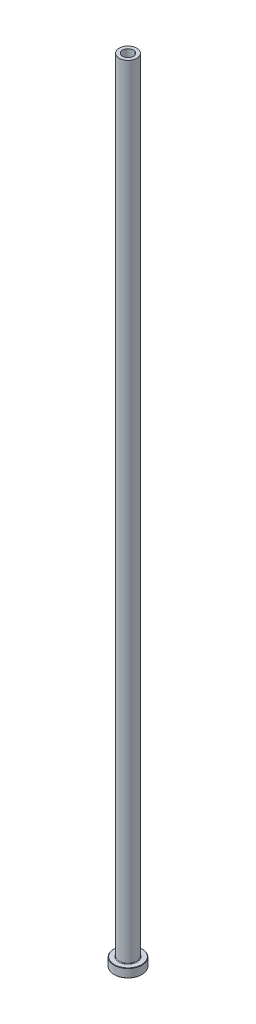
from build123d import *

# Parameters (mm, degrees)
FILLET1_R     = 0.3
CHAMFER1_SIZE = 0.2
CHAMFER3_SIZE = 0.5


with BuildPart() as part:
    # Sketch1 → Revolve1 (revolve)
    with BuildSketch(Plane.XY, mode=Mode.PRIVATE) as revolve1_sk:
        Polygon((-3.1, 450), (-5, 450), (-5, 5), (-8, 5), (-8, 0), (-3.35, 0), (-3.35, 393), (-3.1, 405), align=None)
    revolve(revolve1_sk.sketch.rotate(Axis((0, 92.187680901, 0), (0, -1, 0)), 270), axis=Axis((0, 92.187680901, 0), (0, -1, 0)))

    # Fillet1
    fillet1_edges = [part.edges().sort_by_distance(p)[0] for p in [
        (0, 5, -5),
    ]]
    fillet(fillet1_edges, radius=FILLET1_R)

    # Chamfer1
    chamfer1_edges = [part.edges().sort_by_distance(p)[0] for p in [
        (0, 0, -8),
        (0, 5, -8),
    ]]
    chamfer(chamfer1_edges, length=CHAMFER1_SIZE)

    # Chamfer3
    chamfer3_edges = [part.edges().sort_by_distance(p)[0] for p in [
        (0, 0, -3.35),
    ]]
    chamfer(chamfer3_edges, length=CHAMFER3_SIZE)


solid = part.part
